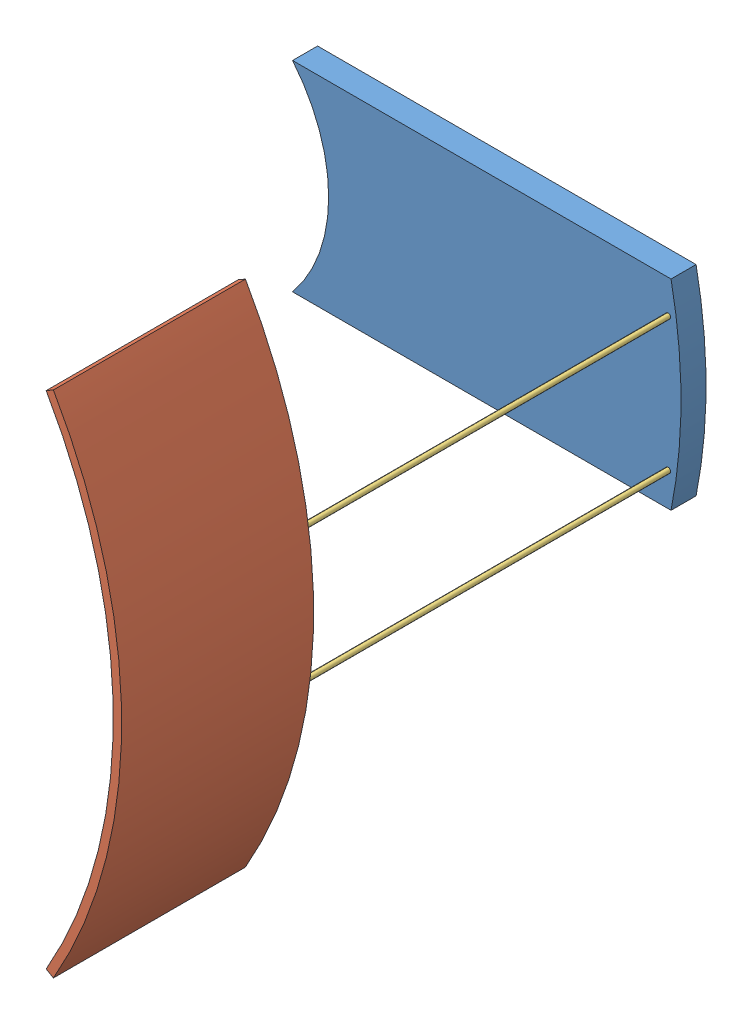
SolidWorks assembly Assemblage1.sldasm, configuration Défaut (file format 7000). Lengths in mm.
Overall size (232.64 305 350).
4 component instances, 3 part files, 7 mates.
Components (placement in the parent):
- porte cible telescope-1-1: porte cible telescope-1.SLDPRT [Défaut] at (-390.8098 -22.6644 225.1398) size (232.64 120 15)
- porte cible telescope-2-1: porte cible telescope-2.SLDPRT [Défaut] at (-390.8098 -22.6644 460.1398) size (45.19 305 115)
- Tige guide cible telescope-1: Tige guide cible telescope.SLDPRT [Défaut] at (-93.4884 -62.6644 225.1398) size (3 3 250)
- Tige guide cible telescope-2: Tige guide cible telescope.SLDPRT [Défaut] at (-93.4884 17.3356 225.1398) size (3 3 250)
Mates (geometry in assembly coordinates):
- Coaxiale1: concentric aligned: cylinder of porte cible telescope-1-1 through (-93.4884 17.3356 240.1398) axis (0 0 -1) radius 1.5; cylinder of porte cible telescope-2-1 through (-93.4884 17.3356 475.1398) axis (0 0 -1) radius 1.5
- Coaxiale2: concentric aligned: cylinder of porte cible telescope-1-1 through (-93.4884 -62.6644 240.1398) axis (0 0 -1) radius 1.5; cylinder of porte cible telescope-2-1 through (-93.4884 -62.6644 475.1398) axis (0 0 -1) radius 1.5
- Coaxiale3: concentric aligned: cylinder of porte cible telescope-1-1 through (-93.4884 -62.6644 240.1398) axis (0 0 -1) radius 1.5; cylinder of Tige guide cible telescope-1 through (-93.4884 -62.6644 475.1398) axis (0 0 -1) radius 1.5
- Coïncidente1: coincident aligned: plane of porte cible telescope-1-1 through (-390.8098 -22.6644 225.1398) normal (0 0 -1); plane of Tige guide cible telescope-1 through (-93.4884 -62.6644 225.1398) normal (0 0 -1)
- Coaxiale4: concentric aligned: cylinder of porte cible telescope-1-1 through (-93.4884 17.3356 240.1398) axis (0 0 -1) radius 1.5; cylinder of Tige guide cible telescope-2 through (-93.4884 17.3356 475.1398) axis (0 0 -1) radius 1.5
- Coïncidente2: coincident aligned: plane of porte cible telescope-1-1 through (-390.8098 -22.6644 225.1398) normal (0 0 -1); plane of Tige guide cible telescope-2 through (-93.4884 17.3356 225.1398) normal (0 0 -1)
- Coïncidente3: coincident aligned: plane of porte cible telescope-2-1 through (-390.8098 -22.6644 475.1398) normal (0 0 1); plane of Tige guide cible telescope-1 through (-93.4884 -62.6644 475.1398) normal (0 0 1)
